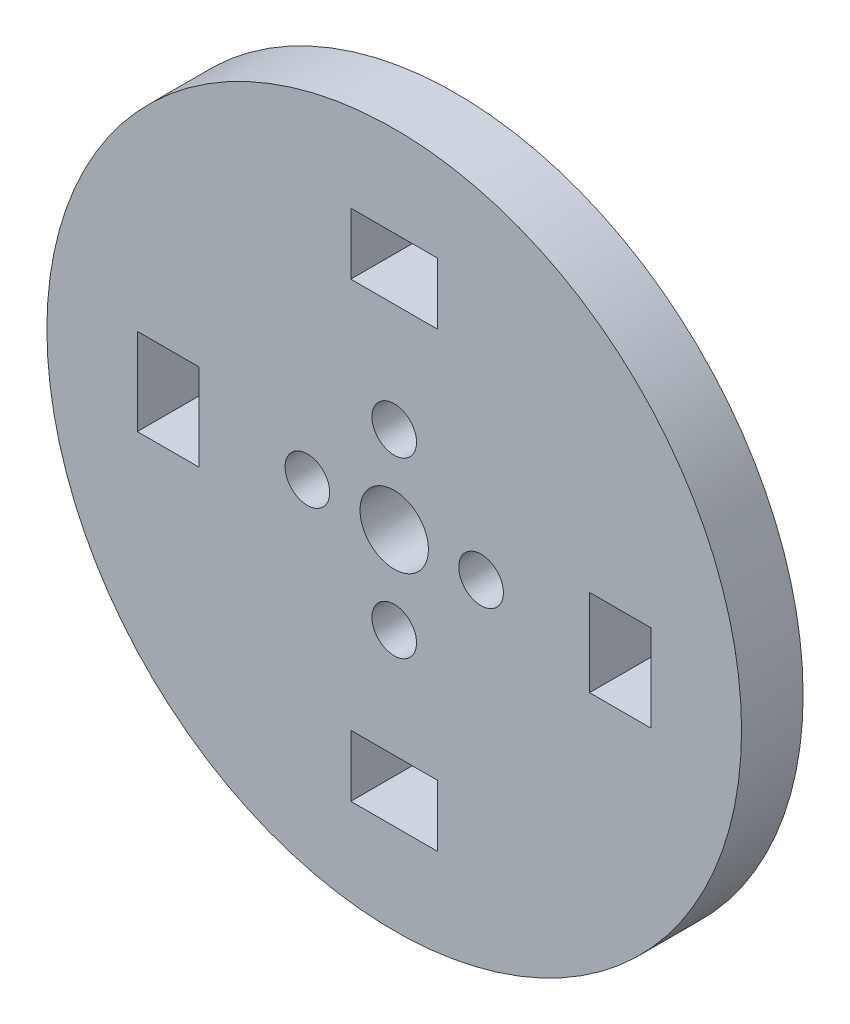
ISO-10303-21;
HEADER;
FILE_DESCRIPTION(('STEP AP214'),'2;1');
FILE_NAME('part.step','',(''),(''),'','','');
FILE_SCHEMA(('AUTOMOTIVE_DESIGN { 1 0 10303 214 1 1 1 1 }'));
ENDSEC;
DATA;
#1=APPLICATION_CONTEXT('core data for automotive mechanical design processes');
#2=APPLICATION_PROTOCOL_DEFINITION('international standard','automotive_design',2000,#1);
#3=PRODUCT_CONTEXT('',#1,'mechanical');
#4=PRODUCT('Part','Part','',(#3));
#5=PRODUCT_RELATED_PRODUCT_CATEGORY('part','',(#4));
#6=PRODUCT_DEFINITION_FORMATION('','',#4);
#7=PRODUCT_DEFINITION_CONTEXT('part definition',#1,'design');
#8=PRODUCT_DEFINITION('design','',#6,#7);
#9=PRODUCT_DEFINITION_SHAPE('','',#8);
#10=(LENGTH_UNIT() NAMED_UNIT(*) SI_UNIT(.MILLI.,.METRE.));
#11=(NAMED_UNIT(*) PLANE_ANGLE_UNIT() SI_UNIT($,.RADIAN.));
#12=(NAMED_UNIT(*) SI_UNIT($,.STERADIAN.) SOLID_ANGLE_UNIT());
#13=UNCERTAINTY_MEASURE_WITH_UNIT(LENGTH_MEASURE(1.E-05),#10,'distance_accuracy_value','');
#14=(GEOMETRIC_REPRESENTATION_CONTEXT(3) GLOBAL_UNCERTAINTY_ASSIGNED_CONTEXT((#13)) GLOBAL_UNIT_ASSIGNED_CONTEXT((#10,
#11,#12)) REPRESENTATION_CONTEXT('',''));
#15=CARTESIAN_POINT('',(0.,0.,0.));
#16=DIRECTION('',(0.,0.,1.));
#17=DIRECTION('',(1.,0.,0.));
#18=AXIS2_PLACEMENT_3D('',#15,#16,#17);
#19=CARTESIAN_POINT('',(0.,0.,4.5));
#20=DIRECTION('',(0.,0.,1.));
#21=DIRECTION('',(1.,0.,0.));
#22=AXIS2_PLACEMENT_3D('',#19,#20,#21);
#23=PLANE('',#22);
#24=CARTESIAN_POINT('',(0.,6.35,4.5));
#25=DIRECTION('',(0.,0.,1.));
#26=DIRECTION('',(1.,0.,0.));
#27=AXIS2_PLACEMENT_3D('',#24,#25,#26);
#28=CIRCLE('',#27,1.63195);
#29=CARTESIAN_POINT('',(1.63195,6.35,4.5));
#30=VERTEX_POINT('',#29);
#31=EDGE_CURVE('E310',#30,#30,#28,.T.);
#32=ORIENTED_EDGE('',*,*,#31,.F.);
#33=EDGE_LOOP('',(#32));
#34=FACE_BOUND('',#33,.T.);
#35=CARTESIAN_POINT('',(6.35000000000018,1.79700204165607E-13,4.5));
#36=DIRECTION('',(0.,0.,1.));
#37=DIRECTION('',(1.,0.,0.));
#38=AXIS2_PLACEMENT_3D('',#35,#36,#37);
#39=CIRCLE('',#38,1.63195);
#40=CARTESIAN_POINT('',(7.98195000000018,1.79700204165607E-13,4.5));
#41=VERTEX_POINT('',#40);
#42=EDGE_CURVE('E314',#41,#41,#39,.T.);
#43=ORIENTED_EDGE('',*,*,#42,.F.);
#44=EDGE_LOOP('',(#43));
#45=FACE_BOUND('',#44,.T.);
#46=CARTESIAN_POINT('',(3.59400408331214E-13,-6.35,4.5));
#47=DIRECTION('',(0.,0.,1.));
#48=DIRECTION('',(1.,0.,0.));
#49=AXIS2_PLACEMENT_3D('',#46,#47,#48);
#50=CIRCLE('',#49,1.63195);
#51=CARTESIAN_POINT('',(1.63195000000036,-6.35,4.5));
#52=VERTEX_POINT('',#51);
#53=EDGE_CURVE('E318',#52,#52,#50,.T.);
#54=ORIENTED_EDGE('',*,*,#53,.F.);
#55=EDGE_LOOP('',(#54));
#56=FACE_BOUND('',#55,.T.);
#57=CARTESIAN_POINT('',(-6.34999999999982,-1.78922553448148E-13,4.5));
#58=DIRECTION('',(0.,0.,1.));
#59=DIRECTION('',(1.,0.,0.));
#60=AXIS2_PLACEMENT_3D('',#57,#58,#59);
#61=CIRCLE('',#60,1.63195);
#62=CARTESIAN_POINT('',(-4.71804999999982,-1.78922553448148E-13,4.5));
#63=VERTEX_POINT('',#62);
#64=EDGE_CURVE('E322',#63,#63,#61,.T.);
#65=ORIENTED_EDGE('',*,*,#64,.F.);
#66=EDGE_LOOP('',(#65));
#67=FACE_BOUND('',#66,.T.);
#68=DIRECTION('',(0.,-1.,0.));
#69=VECTOR('',#68,1.);
#70=CARTESIAN_POINT('',(-3.175,0.,4.5));
#71=LINE('',#70,#69);
#72=CARTESIAN_POINT('',(-3.175,18.7835533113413,4.5));
#73=VERTEX_POINT('',#72);
#74=CARTESIAN_POINT('',(-3.175,14.2835533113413,4.5));
#75=VERTEX_POINT('',#74);
#76=EDGE_CURVE('E210',#73,#75,#71,.T.);
#77=ORIENTED_EDGE('',*,*,#76,.F.);
#78=DIRECTION('',(1.,0.,0.));
#79=VECTOR('',#78,1.);
#80=CARTESIAN_POINT('',(0.,18.7835533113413,4.5));
#81=LINE('',#80,#79);
#82=CARTESIAN_POINT('',(3.175,18.7835533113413,4.5));
#83=VERTEX_POINT('',#82);
#84=EDGE_CURVE('E221',#73,#83,#81,.T.);
#85=ORIENTED_EDGE('',*,*,#84,.T.);
#86=DIRECTION('',(0.,-1.,0.));
#87=VECTOR('',#86,1.);
#88=CARTESIAN_POINT('',(3.175,0.,4.5));
#89=LINE('',#88,#87);
#90=CARTESIAN_POINT('',(3.175,14.2835533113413,4.5));
#91=VERTEX_POINT('',#90);
#92=EDGE_CURVE('E234',#83,#91,#89,.T.);
#93=ORIENTED_EDGE('',*,*,#92,.T.);
#94=DIRECTION('',(1.,0.,0.));
#95=VECTOR('',#94,1.);
#96=CARTESIAN_POINT('',(0.,14.2835533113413,4.5));
#97=LINE('',#96,#95);
#98=EDGE_CURVE('E231',#75,#91,#97,.T.);
#99=ORIENTED_EDGE('',*,*,#98,.F.);
#100=EDGE_LOOP('',(#77,#85,#93,#99));
#101=FACE_BOUND('',#100,.T.);
#102=CARTESIAN_POINT('',(0.,0.,4.5));
#103=DIRECTION('',(0.,0.,1.));
#104=DIRECTION('',(1.,0.,0.));
#105=AXIS2_PLACEMENT_3D('',#102,#103,#104);
#106=CIRCLE('',#105,25.4);
#107=CARTESIAN_POINT('',(25.4,0.,4.5));
#108=VERTEX_POINT('',#107);
#109=EDGE_CURVE('E11',#108,#108,#106,.T.);
#110=ORIENTED_EDGE('',*,*,#109,.T.);
#111=EDGE_LOOP('',(#110));
#112=FACE_BOUND('',#111,.T.);
#113=CARTESIAN_POINT('',(0.,0.,4.5));
#114=DIRECTION('',(0.,0.,1.));
#115=DIRECTION('',(1.,0.,0.));
#116=AXIS2_PLACEMENT_3D('',#113,#114,#115);
#117=CIRCLE('',#116,2.5);
#118=CARTESIAN_POINT('',(2.5,0.,4.5));
#119=VERTEX_POINT('',#118);
#120=EDGE_CURVE('E279',#119,#119,#117,.T.);
#121=ORIENTED_EDGE('',*,*,#120,.F.);
#122=EDGE_LOOP('',(#121));
#123=FACE_BOUND('',#122,.T.);
#124=DIRECTION('',(0.,1.,0.));
#125=VECTOR('',#124,1.);
#126=CARTESIAN_POINT('',(-18.7835533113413,2.05255249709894E-13,4.5));
#127=LINE('',#126,#125);
#128=CARTESIAN_POINT('',(-18.7835533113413,-3.17499999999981,4.5));
#129=VERTEX_POINT('',#128);
#130=CARTESIAN_POINT('',(-18.7835533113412,3.17500000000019,4.5));
#131=VERTEX_POINT('',#130);
#132=EDGE_CURVE('E262',#129,#131,#127,.T.);
#133=ORIENTED_EDGE('',*,*,#132,.T.);
#134=DIRECTION('',(1.,0.,0.));
#135=VECTOR('',#134,1.);
#136=CARTESIAN_POINT('',(0.,3.175,4.5));
#137=LINE('',#136,#135);
#138=CARTESIAN_POINT('',(-14.2835533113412,3.17500000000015,4.5));
#139=VERTEX_POINT('',#138);
#140=EDGE_CURVE('E241',#131,#139,#137,.T.);
#141=ORIENTED_EDGE('',*,*,#140,.T.);
#142=DIRECTION('',(0.,1.,0.));
#143=VECTOR('',#142,1.);
#144=CARTESIAN_POINT('',(-14.2835533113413,1.4827788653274E-13,4.5));
#145=LINE('',#144,#143);
#146=CARTESIAN_POINT('',(-14.2835533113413,-3.17499999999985,4.5));
#147=VERTEX_POINT('',#146);
#148=EDGE_CURVE('E251',#147,#139,#145,.T.);
#149=ORIENTED_EDGE('',*,*,#148,.F.);
#150=DIRECTION('',(1.,0.,0.));
#151=VECTOR('',#150,1.);
#152=CARTESIAN_POINT('',(0.,-3.175,4.5));
#153=LINE('',#152,#151);
#154=EDGE_CURVE('E265',#129,#147,#153,.T.);
#155=ORIENTED_EDGE('',*,*,#154,.F.);
#156=EDGE_LOOP('',(#133,#141,#149,#155));
#157=FACE_BOUND('',#156,.T.);
#158=DIRECTION('',(0.,-1.,0.));
#159=VECTOR('',#158,1.);
#160=CARTESIAN_POINT('',(18.7835533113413,0.,4.5));
#161=LINE('',#160,#159);
#162=CARTESIAN_POINT('',(18.7835533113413,3.17499999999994,4.5));
#163=VERTEX_POINT('',#162);
#164=CARTESIAN_POINT('',(18.7835533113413,-3.17500000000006,4.5));
#165=VERTEX_POINT('',#164);
#166=EDGE_CURVE('E200',#163,#165,#161,.T.);
#167=ORIENTED_EDGE('',*,*,#166,.T.);
#168=DIRECTION('',(-1.,0.,0.));
#169=VECTOR('',#168,1.);
#170=CARTESIAN_POINT('',(0.,-3.175,4.5));
#171=LINE('',#170,#169);
#172=CARTESIAN_POINT('',(14.2835533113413,-3.17500000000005,4.5));
#173=VERTEX_POINT('',#172);
#174=EDGE_CURVE('E182',#165,#173,#171,.T.);
#175=ORIENTED_EDGE('',*,*,#174,.T.);
#176=DIRECTION('',(0.,-1.,0.));
#177=VECTOR('',#176,1.);
#178=CARTESIAN_POINT('',(14.2835533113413,0.,4.5));
#179=LINE('',#178,#177);
#180=CARTESIAN_POINT('',(14.2835533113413,3.17499999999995,4.5));
#181=VERTEX_POINT('',#180);
#182=EDGE_CURVE('E189',#181,#173,#179,.T.);
#183=ORIENTED_EDGE('',*,*,#182,.F.);
#184=DIRECTION('',(-1.,0.,0.));
#185=VECTOR('',#184,1.);
#186=CARTESIAN_POINT('',(0.,3.175,4.5));
#187=LINE('',#186,#185);
#188=EDGE_CURVE('E203',#163,#181,#187,.T.);
#189=ORIENTED_EDGE('',*,*,#188,.F.);
#190=EDGE_LOOP('',(#167,#175,#183,#189));
#191=FACE_BOUND('',#190,.T.);
#192=DIRECTION('',(-1.,0.,0.));
#193=VECTOR('',#192,1.);
#194=CARTESIAN_POINT('',(-1.23153149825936E-13,-18.7835533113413,4.5));
#195=LINE('',#194,#193);
#196=CARTESIAN_POINT('',(3.17499999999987,-18.7835533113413,4.5));
#197=VERTEX_POINT('',#196);
#198=CARTESIAN_POINT('',(-3.17500000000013,-18.7835533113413,4.5));
#199=VERTEX_POINT('',#198);
#200=EDGE_CURVE('E176',#197,#199,#195,.T.);
#201=ORIENTED_EDGE('',*,*,#200,.T.);
#202=DIRECTION('',(0.,1.,0.));
#203=VECTOR('',#202,1.);
#204=CARTESIAN_POINT('',(-3.175,0.,4.5));
#205=LINE('',#204,#203);
#206=CARTESIAN_POINT('',(-3.1750000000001,-14.2835533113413,4.5));
#207=VERTEX_POINT('',#206);
#208=EDGE_CURVE('E49',#199,#207,#205,.T.);
#209=ORIENTED_EDGE('',*,*,#208,.T.);
#210=DIRECTION('',(-1.,0.,0.));
#211=VECTOR('',#210,1.);
#212=CARTESIAN_POINT('',(-1.01453290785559E-13,-14.2835533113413,4.5));
#213=LINE('',#212,#211);
#214=CARTESIAN_POINT('',(3.1749999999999,-14.2835533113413,4.5));
#215=VERTEX_POINT('',#214);
#216=EDGE_CURVE('E164',#215,#207,#213,.T.);
#217=ORIENTED_EDGE('',*,*,#216,.F.);
#218=DIRECTION('',(0.,1.,0.));
#219=VECTOR('',#218,1.);
#220=CARTESIAN_POINT('',(3.175,0.,4.5));
#221=LINE('',#220,#219);
#222=EDGE_CURVE('E167',#197,#215,#221,.T.);
#223=ORIENTED_EDGE('',*,*,#222,.F.);
#224=EDGE_LOOP('',(#201,#209,#217,#223));
#225=FACE_BOUND('',#224,.T.);
#226=ADVANCED_FACE('F34',(#34,#45,#56,#67,#101,#112,#123,#157,#191,#225),#23,.T.);
#227=CARTESIAN_POINT('',(0.,0.,0.));
#228=DIRECTION('',(0.,0.,1.));
#229=DIRECTION('',(1.,0.,0.));
#230=AXIS2_PLACEMENT_3D('',#227,#228,#229);
#231=PLANE('',#230);
#232=CARTESIAN_POINT('',(0.,6.35,0.));
#233=DIRECTION('',(0.,0.,1.));
#234=DIRECTION('',(1.,0.,0.));
#235=AXIS2_PLACEMENT_3D('',#232,#233,#234);
#236=CIRCLE('',#235,1.63195);
#237=CARTESIAN_POINT('',(1.63195,6.35,0.));
#238=VERTEX_POINT('',#237);
#239=EDGE_CURVE('E517',#238,#238,#236,.T.);
#240=ORIENTED_EDGE('',*,*,#239,.T.);
#241=EDGE_LOOP('',(#240));
#242=FACE_BOUND('',#241,.T.);
#243=CARTESIAN_POINT('',(6.35000000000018,1.79700204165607E-13,0.));
#244=DIRECTION('',(0.,0.,1.));
#245=DIRECTION('',(1.,0.,0.));
#246=AXIS2_PLACEMENT_3D('',#243,#244,#245);
#247=CIRCLE('',#246,1.63195);
#248=CARTESIAN_POINT('',(7.98195000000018,1.79700204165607E-13,0.));
#249=VERTEX_POINT('',#248);
#250=EDGE_CURVE('E519',#249,#249,#247,.T.);
#251=ORIENTED_EDGE('',*,*,#250,.T.);
#252=EDGE_LOOP('',(#251));
#253=FACE_BOUND('',#252,.T.);
#254=CARTESIAN_POINT('',(3.59400408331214E-13,-6.35,0.));
#255=DIRECTION('',(0.,0.,1.));
#256=DIRECTION('',(1.,0.,0.));
#257=AXIS2_PLACEMENT_3D('',#254,#255,#256);
#258=CIRCLE('',#257,1.63195);
#259=CARTESIAN_POINT('',(1.63195000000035,-6.35,0.));
#260=VERTEX_POINT('',#259);
#261=EDGE_CURVE('E526',#260,#260,#258,.T.);
#262=ORIENTED_EDGE('',*,*,#261,.T.);
#263=EDGE_LOOP('',(#262));
#264=FACE_BOUND('',#263,.T.);
#265=CARTESIAN_POINT('',(-6.34999999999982,-1.78922553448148E-13,0.));
#266=DIRECTION('',(0.,0.,1.));
#267=DIRECTION('',(1.,0.,0.));
#268=AXIS2_PLACEMENT_3D('',#265,#266,#267);
#269=CIRCLE('',#268,1.63195);
#270=CARTESIAN_POINT('',(-4.71804999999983,-1.78922553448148E-13,0.));
#271=VERTEX_POINT('',#270);
#272=EDGE_CURVE('E170',#271,#271,#269,.T.);
#273=ORIENTED_EDGE('',*,*,#272,.T.);
#274=EDGE_LOOP('',(#273));
#275=FACE_BOUND('',#274,.T.);
#276=DIRECTION('',(-1.,0.,0.));
#277=VECTOR('',#276,1.);
#278=CARTESIAN_POINT('',(0.,-3.175,0.));
#279=LINE('',#278,#277);
#280=CARTESIAN_POINT('',(18.7835533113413,-3.17500000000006,0.));
#281=VERTEX_POINT('',#280);
#282=CARTESIAN_POINT('',(14.2835533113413,-3.17500000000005,0.));
#283=VERTEX_POINT('',#282);
#284=EDGE_CURVE('E186',#281,#283,#279,.T.);
#285=ORIENTED_EDGE('',*,*,#284,.F.);
#286=DIRECTION('',(0.,-1.,0.));
#287=VECTOR('',#286,1.);
#288=CARTESIAN_POINT('',(18.7835533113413,0.,0.));
#289=LINE('',#288,#287);
#290=CARTESIAN_POINT('',(18.7835533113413,3.17499999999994,0.));
#291=VERTEX_POINT('',#290);
#292=EDGE_CURVE('E188',#291,#281,#289,.T.);
#293=ORIENTED_EDGE('',*,*,#292,.F.);
#294=DIRECTION('',(-1.,0.,0.));
#295=VECTOR('',#294,1.);
#296=CARTESIAN_POINT('',(0.,3.175,0.));
#297=LINE('',#296,#295);
#298=CARTESIAN_POINT('',(14.2835533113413,3.17499999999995,0.));
#299=VERTEX_POINT('',#298);
#300=EDGE_CURVE('E191',#291,#299,#297,.T.);
#301=ORIENTED_EDGE('',*,*,#300,.T.);
#302=DIRECTION('',(0.,-1.,0.));
#303=VECTOR('',#302,1.);
#304=CARTESIAN_POINT('',(14.2835533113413,0.,0.));
#305=LINE('',#304,#303);
#306=EDGE_CURVE('E194',#299,#283,#305,.T.);
#307=ORIENTED_EDGE('',*,*,#306,.T.);
#308=EDGE_LOOP('',(#285,#293,#301,#307));
#309=FACE_BOUND('',#308,.T.);
#310=DIRECTION('',(1.,0.,0.));
#311=VECTOR('',#310,1.);
#312=CARTESIAN_POINT('',(0.,18.7835533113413,0.));
#313=LINE('',#312,#311);
#314=CARTESIAN_POINT('',(-3.175,18.7835533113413,0.));
#315=VERTEX_POINT('',#314);
#316=CARTESIAN_POINT('',(3.175,18.7835533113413,0.));
#317=VERTEX_POINT('',#316);
#318=EDGE_CURVE('E227',#315,#317,#313,.T.);
#319=ORIENTED_EDGE('',*,*,#318,.F.);
#320=DIRECTION('',(0.,-1.,0.));
#321=VECTOR('',#320,1.);
#322=CARTESIAN_POINT('',(-3.175,0.,0.));
#323=LINE('',#322,#321);
#324=CARTESIAN_POINT('',(-3.175,14.2835533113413,0.));
#325=VERTEX_POINT('',#324);
#326=EDGE_CURVE('E217',#315,#325,#323,.T.);
#327=ORIENTED_EDGE('',*,*,#326,.T.);
#328=DIRECTION('',(1.,0.,0.));
#329=VECTOR('',#328,1.);
#330=CARTESIAN_POINT('',(0.,14.2835533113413,0.));
#331=LINE('',#330,#329);
#332=CARTESIAN_POINT('',(3.175,14.2835533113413,0.));
#333=VERTEX_POINT('',#332);
#334=EDGE_CURVE('E220',#325,#333,#331,.T.);
#335=ORIENTED_EDGE('',*,*,#334,.T.);
#336=DIRECTION('',(0.,-1.,0.));
#337=VECTOR('',#336,1.);
#338=CARTESIAN_POINT('',(3.175,0.,0.));
#339=LINE('',#338,#337);
#340=EDGE_CURVE('E224',#317,#333,#339,.T.);
#341=ORIENTED_EDGE('',*,*,#340,.F.);
#342=EDGE_LOOP('',(#319,#327,#335,#341));
#343=FACE_BOUND('',#342,.T.);
#344=CARTESIAN_POINT('',(0.,0.,0.));
#345=DIRECTION('',(0.,0.,1.));
#346=DIRECTION('',(1.,0.,0.));
#347=AXIS2_PLACEMENT_3D('',#344,#345,#346);
#348=CIRCLE('',#347,2.5);
#349=CARTESIAN_POINT('',(2.5,0.,0.));
#350=VERTEX_POINT('',#349);
#351=EDGE_CURVE('E272',#350,#350,#348,.T.);
#352=ORIENTED_EDGE('',*,*,#351,.T.);
#353=EDGE_LOOP('',(#352));
#354=FACE_BOUND('',#353,.T.);
#355=CARTESIAN_POINT('',(0.,0.,0.));
#356=DIRECTION('',(0.,0.,1.));
#357=DIRECTION('',(1.,0.,0.));
#358=AXIS2_PLACEMENT_3D('',#355,#356,#357);
#359=CIRCLE('',#358,25.4);
#360=CARTESIAN_POINT('',(25.4,0.,0.));
#361=VERTEX_POINT('',#360);
#362=EDGE_CURVE('E38',#361,#361,#359,.T.);
#363=ORIENTED_EDGE('',*,*,#362,.F.);
#364=EDGE_LOOP('',(#363));
#365=FACE_BOUND('',#364,.T.);
#366=DIRECTION('',(1.,0.,0.));
#367=VECTOR('',#366,1.);
#368=CARTESIAN_POINT('',(0.,3.175,0.));
#369=LINE('',#368,#367);
#370=CARTESIAN_POINT('',(-18.7835533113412,3.17500000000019,0.));
#371=VERTEX_POINT('',#370);
#372=CARTESIAN_POINT('',(-14.2835533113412,3.17500000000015,0.));
#373=VERTEX_POINT('',#372);
#374=EDGE_CURVE('E248',#371,#373,#369,.T.);
#375=ORIENTED_EDGE('',*,*,#374,.F.);
#376=DIRECTION('',(0.,1.,0.));
#377=VECTOR('',#376,1.);
#378=CARTESIAN_POINT('',(-18.7835533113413,2.05255249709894E-13,0.));
#379=LINE('',#378,#377);
#380=CARTESIAN_POINT('',(-18.7835533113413,-3.17499999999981,0.));
#381=VERTEX_POINT('',#380);
#382=EDGE_CURVE('E250',#381,#371,#379,.T.);
#383=ORIENTED_EDGE('',*,*,#382,.F.);
#384=DIRECTION('',(1.,0.,0.));
#385=VECTOR('',#384,1.);
#386=CARTESIAN_POINT('',(0.,-3.175,0.));
#387=LINE('',#386,#385);
#388=CARTESIAN_POINT('',(-14.2835533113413,-3.17499999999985,0.));
#389=VERTEX_POINT('',#388);
#390=EDGE_CURVE('E253',#381,#389,#387,.T.);
#391=ORIENTED_EDGE('',*,*,#390,.T.);
#392=DIRECTION('',(0.,1.,0.));
#393=VECTOR('',#392,1.);
#394=CARTESIAN_POINT('',(-14.2835533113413,1.4827788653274E-13,0.));
#395=LINE('',#394,#393);
#396=EDGE_CURVE('E256',#389,#373,#395,.T.);
#397=ORIENTED_EDGE('',*,*,#396,.T.);
#398=EDGE_LOOP('',(#375,#383,#391,#397));
#399=FACE_BOUND('',#398,.T.);
#400=DIRECTION('',(0.,1.,0.));
#401=VECTOR('',#400,1.);
#402=CARTESIAN_POINT('',(-3.175,0.,0.));
#403=LINE('',#402,#401);
#404=CARTESIAN_POINT('',(-3.17500000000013,-18.7835533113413,0.));
#405=VERTEX_POINT('',#404);
#406=CARTESIAN_POINT('',(-3.1750000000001,-14.2835533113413,0.));
#407=VERTEX_POINT('',#406);
#408=EDGE_CURVE('E155',#405,#407,#403,.T.);
#409=ORIENTED_EDGE('',*,*,#408,.F.);
#410=DIRECTION('',(-1.,0.,0.));
#411=VECTOR('',#410,1.);
#412=CARTESIAN_POINT('',(-1.23153149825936E-13,-18.7835533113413,0.));
#413=LINE('',#412,#411);
#414=CARTESIAN_POINT('',(3.17499999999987,-18.7835533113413,0.));
#415=VERTEX_POINT('',#414);
#416=EDGE_CURVE('E147',#415,#405,#413,.T.);
#417=ORIENTED_EDGE('',*,*,#416,.F.);
#418=DIRECTION('',(0.,1.,0.));
#419=VECTOR('',#418,1.);
#420=CARTESIAN_POINT('',(3.175,0.,0.));
#421=LINE('',#420,#419);
#422=CARTESIAN_POINT('',(3.1749999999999,-14.2835533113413,0.));
#423=VERTEX_POINT('',#422);
#424=EDGE_CURVE('E57',#415,#423,#421,.T.);
#425=ORIENTED_EDGE('',*,*,#424,.T.);
#426=DIRECTION('',(-1.,0.,0.));
#427=VECTOR('',#426,1.);
#428=CARTESIAN_POINT('',(-1.01453290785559E-13,-14.2835533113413,0.));
#429=LINE('',#428,#427);
#430=EDGE_CURVE('E159',#423,#407,#429,.T.);
#431=ORIENTED_EDGE('',*,*,#430,.T.);
#432=EDGE_LOOP('',(#409,#417,#425,#431));
#433=FACE_BOUND('',#432,.T.);
#434=ADVANCED_FACE('F162',(#242,#253,#264,#275,#309,#343,#354,#365,#399,#433),#231,.F.);
#435=CARTESIAN_POINT('',(0.,0.,4.5));
#436=DIRECTION('',(0.,0.,-1.));
#437=DIRECTION('',(-1.,0.,0.));
#438=AXIS2_PLACEMENT_3D('',#435,#436,#437);
#439=CYLINDRICAL_SURFACE('',#438,25.4);
#440=ORIENTED_EDGE('',*,*,#109,.F.);
#441=EDGE_LOOP('',(#440));
#442=FACE_BOUND('',#441,.T.);
#443=ORIENTED_EDGE('',*,*,#362,.T.);
#444=EDGE_LOOP('',(#443));
#445=FACE_BOUND('',#444,.T.);
#446=ADVANCED_FACE('F36',(#442,#445),#439,.T.);
#447=CARTESIAN_POINT('',(0.,0.,4.5));
#448=DIRECTION('',(0.,0.,-1.));
#449=DIRECTION('',(-1.,0.,0.));
#450=AXIS2_PLACEMENT_3D('',#447,#448,#449);
#451=CYLINDRICAL_SURFACE('',#450,2.5);
#452=ORIENTED_EDGE('',*,*,#120,.T.);
#453=EDGE_LOOP('',(#452));
#454=FACE_BOUND('',#453,.T.);
#455=ORIENTED_EDGE('',*,*,#351,.F.);
#456=EDGE_LOOP('',(#455));
#457=FACE_BOUND('',#456,.T.);
#458=ADVANCED_FACE('F287',(#454,#457),#451,.F.);
#459=CARTESIAN_POINT('',(0.,3.175,0.));
#460=DIRECTION('',(0.,-1.,0.));
#461=DIRECTION('',(1.,0.,0.));
#462=AXIS2_PLACEMENT_3D('',#459,#460,#461);
#463=PLANE('',#462);
#464=ORIENTED_EDGE('',*,*,#140,.F.);
#465=DIRECTION('',(0.,0.,1.));
#466=VECTOR('',#465,1.);
#467=CARTESIAN_POINT('',(-18.7835533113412,3.17500000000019,0.));
#468=LINE('',#467,#466);
#469=EDGE_CURVE('E259',#371,#131,#468,.T.);
#470=ORIENTED_EDGE('',*,*,#469,.F.);
#471=ORIENTED_EDGE('',*,*,#374,.T.);
#472=DIRECTION('',(0.,0.,1.));
#473=VECTOR('',#472,1.);
#474=CARTESIAN_POINT('',(-14.2835533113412,3.17500000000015,0.));
#475=LINE('',#474,#473);
#476=EDGE_CURVE('E270',#373,#139,#475,.T.);
#477=ORIENTED_EDGE('',*,*,#476,.T.);
#478=EDGE_LOOP('',(#464,#470,#471,#477));
#479=FACE_BOUND('',#478,.T.);
#480=ADVANCED_FACE('F289',(#479),#463,.T.);
#481=CARTESIAN_POINT('',(-14.2835533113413,1.4827788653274E-13,0.));
#482=DIRECTION('',(1.,0.,0.));
#483=DIRECTION('',(0.,1.,0.));
#484=AXIS2_PLACEMENT_3D('',#481,#482,#483);
#485=PLANE('',#484);
#486=ORIENTED_EDGE('',*,*,#148,.T.);
#487=ORIENTED_EDGE('',*,*,#476,.F.);
#488=ORIENTED_EDGE('',*,*,#396,.F.);
#489=DIRECTION('',(0.,0.,1.));
#490=VECTOR('',#489,1.);
#491=CARTESIAN_POINT('',(-14.2835533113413,-3.17499999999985,0.));
#492=LINE('',#491,#490);
#493=EDGE_CURVE('E273',#389,#147,#492,.T.);
#494=ORIENTED_EDGE('',*,*,#493,.T.);
#495=EDGE_LOOP('',(#486,#487,#488,#494));
#496=FACE_BOUND('',#495,.T.);
#497=ADVANCED_FACE('F296',(#496),#485,.F.);
#498=CARTESIAN_POINT('',(0.,-3.175,0.));
#499=DIRECTION('',(0.,-1.,0.));
#500=DIRECTION('',(1.,0.,0.));
#501=AXIS2_PLACEMENT_3D('',#498,#499,#500);
#502=PLANE('',#501);
#503=ORIENTED_EDGE('',*,*,#154,.T.);
#504=ORIENTED_EDGE('',*,*,#493,.F.);
#505=ORIENTED_EDGE('',*,*,#390,.F.);
#506=DIRECTION('',(0.,0.,1.));
#507=VECTOR('',#506,1.);
#508=CARTESIAN_POINT('',(-18.7835533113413,-3.17499999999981,0.));
#509=LINE('',#508,#507);
#510=EDGE_CURVE('E275',#381,#129,#509,.T.);
#511=ORIENTED_EDGE('',*,*,#510,.T.);
#512=EDGE_LOOP('',(#503,#504,#505,#511));
#513=FACE_BOUND('',#512,.T.);
#514=ADVANCED_FACE('F390',(#513),#502,.F.);
#515=CARTESIAN_POINT('',(-18.7835533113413,2.05255249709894E-13,0.));
#516=DIRECTION('',(1.,0.,0.));
#517=DIRECTION('',(0.,1.,0.));
#518=AXIS2_PLACEMENT_3D('',#515,#516,#517);
#519=PLANE('',#518);
#520=ORIENTED_EDGE('',*,*,#132,.F.);
#521=ORIENTED_EDGE('',*,*,#510,.F.);
#522=ORIENTED_EDGE('',*,*,#382,.T.);
#523=ORIENTED_EDGE('',*,*,#469,.T.);
#524=EDGE_LOOP('',(#520,#521,#522,#523));
#525=FACE_BOUND('',#524,.T.);
#526=ADVANCED_FACE('F386',(#525),#519,.T.);
#527=CARTESIAN_POINT('',(-3.175,0.,0.));
#528=DIRECTION('',(-1.,0.,0.));
#529=DIRECTION('',(0.,-1.,0.));
#530=AXIS2_PLACEMENT_3D('',#527,#528,#529);
#531=PLANE('',#530);
#532=ORIENTED_EDGE('',*,*,#76,.T.);
#533=DIRECTION('',(0.,0.,1.));
#534=VECTOR('',#533,1.);
#535=CARTESIAN_POINT('',(-3.175,14.2835533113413,0.));
#536=LINE('',#535,#534);
#537=EDGE_CURVE('E229',#325,#75,#536,.T.);
#538=ORIENTED_EDGE('',*,*,#537,.F.);
#539=ORIENTED_EDGE('',*,*,#326,.F.);
#540=DIRECTION('',(0.,0.,1.));
#541=VECTOR('',#540,1.);
#542=CARTESIAN_POINT('',(-3.175,18.7835533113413,0.));
#543=LINE('',#542,#541);
#544=EDGE_CURVE('E239',#315,#73,#543,.T.);
#545=ORIENTED_EDGE('',*,*,#544,.T.);
#546=EDGE_LOOP('',(#532,#538,#539,#545));
#547=FACE_BOUND('',#546,.T.);
#548=ADVANCED_FACE('F376',(#547),#531,.F.);
#549=CARTESIAN_POINT('',(0.,18.7835533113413,0.));
#550=DIRECTION('',(0.,-1.,0.));
#551=DIRECTION('',(0.,0.,-1.));
#552=AXIS2_PLACEMENT_3D('',#549,#550,#551);
#553=PLANE('',#552);
#554=ORIENTED_EDGE('',*,*,#84,.F.);
#555=ORIENTED_EDGE('',*,*,#544,.F.);
#556=ORIENTED_EDGE('',*,*,#318,.T.);
#557=DIRECTION('',(0.,0.,1.));
#558=VECTOR('',#557,1.);
#559=CARTESIAN_POINT('',(3.175,18.7835533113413,0.));
#560=LINE('',#559,#558);
#561=EDGE_CURVE('E242',#317,#83,#560,.T.);
#562=ORIENTED_EDGE('',*,*,#561,.T.);
#563=EDGE_LOOP('',(#554,#555,#556,#562));
#564=FACE_BOUND('',#563,.T.);
#565=ADVANCED_FACE('F372',(#564),#553,.T.);
#566=CARTESIAN_POINT('',(3.175,0.,0.));
#567=DIRECTION('',(-1.,0.,0.));
#568=DIRECTION('',(0.,-1.,0.));
#569=AXIS2_PLACEMENT_3D('',#566,#567,#568);
#570=PLANE('',#569);
#571=ORIENTED_EDGE('',*,*,#92,.F.);
#572=ORIENTED_EDGE('',*,*,#561,.F.);
#573=ORIENTED_EDGE('',*,*,#340,.T.);
#574=DIRECTION('',(0.,0.,1.));
#575=VECTOR('',#574,1.);
#576=CARTESIAN_POINT('',(3.175,14.2835533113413,0.));
#577=LINE('',#576,#575);
#578=EDGE_CURVE('E244',#333,#91,#577,.T.);
#579=ORIENTED_EDGE('',*,*,#578,.T.);
#580=EDGE_LOOP('',(#571,#572,#573,#579));
#581=FACE_BOUND('',#580,.T.);
#582=ADVANCED_FACE('F375',(#581),#570,.T.);
#583=CARTESIAN_POINT('',(0.,14.2835533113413,0.));
#584=DIRECTION('',(0.,-1.,0.));
#585=DIRECTION('',(0.,0.,-1.));
#586=AXIS2_PLACEMENT_3D('',#583,#584,#585);
#587=PLANE('',#586);
#588=ORIENTED_EDGE('',*,*,#98,.T.);
#589=ORIENTED_EDGE('',*,*,#578,.F.);
#590=ORIENTED_EDGE('',*,*,#334,.F.);
#591=ORIENTED_EDGE('',*,*,#537,.T.);
#592=EDGE_LOOP('',(#588,#589,#590,#591));
#593=FACE_BOUND('',#592,.T.);
#594=ADVANCED_FACE('F370',(#593),#587,.F.);
#595=CARTESIAN_POINT('',(0.,-3.175,0.));
#596=DIRECTION('',(0.,1.,0.));
#597=DIRECTION('',(-1.,0.,0.));
#598=AXIS2_PLACEMENT_3D('',#595,#596,#597);
#599=PLANE('',#598);
#600=ORIENTED_EDGE('',*,*,#174,.F.);
#601=DIRECTION('',(0.,0.,1.));
#602=VECTOR('',#601,1.);
#603=CARTESIAN_POINT('',(18.7835533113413,-3.17500000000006,0.));
#604=LINE('',#603,#602);
#605=EDGE_CURVE('E197',#281,#165,#604,.T.);
#606=ORIENTED_EDGE('',*,*,#605,.F.);
#607=ORIENTED_EDGE('',*,*,#284,.T.);
#608=DIRECTION('',(0.,0.,1.));
#609=VECTOR('',#608,1.);
#610=CARTESIAN_POINT('',(14.2835533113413,-3.17500000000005,0.));
#611=LINE('',#610,#609);
#612=EDGE_CURVE('E208',#283,#173,#611,.T.);
#613=ORIENTED_EDGE('',*,*,#612,.T.);
#614=EDGE_LOOP('',(#600,#606,#607,#613));
#615=FACE_BOUND('',#614,.T.);
#616=ADVANCED_FACE('F360',(#615),#599,.T.);
#617=CARTESIAN_POINT('',(14.2835533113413,0.,0.));
#618=DIRECTION('',(-1.,0.,0.));
#619=DIRECTION('',(0.,-1.,0.));
#620=AXIS2_PLACEMENT_3D('',#617,#618,#619);
#621=PLANE('',#620);
#622=ORIENTED_EDGE('',*,*,#182,.T.);
#623=ORIENTED_EDGE('',*,*,#612,.F.);
#624=ORIENTED_EDGE('',*,*,#306,.F.);
#625=DIRECTION('',(0.,0.,1.));
#626=VECTOR('',#625,1.);
#627=CARTESIAN_POINT('',(14.2835533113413,3.17499999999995,0.));
#628=LINE('',#627,#626);
#629=EDGE_CURVE('E211',#299,#181,#628,.T.);
#630=ORIENTED_EDGE('',*,*,#629,.T.);
#631=EDGE_LOOP('',(#622,#623,#624,#630));
#632=FACE_BOUND('',#631,.T.);
#633=ADVANCED_FACE('F356',(#632),#621,.F.);
#634=CARTESIAN_POINT('',(0.,3.175,0.));
#635=DIRECTION('',(0.,1.,0.));
#636=DIRECTION('',(-1.,0.,0.));
#637=AXIS2_PLACEMENT_3D('',#634,#635,#636);
#638=PLANE('',#637);
#639=ORIENTED_EDGE('',*,*,#188,.T.);
#640=ORIENTED_EDGE('',*,*,#629,.F.);
#641=ORIENTED_EDGE('',*,*,#300,.F.);
#642=DIRECTION('',(0.,0.,1.));
#643=VECTOR('',#642,1.);
#644=CARTESIAN_POINT('',(18.7835533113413,3.17499999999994,0.));
#645=LINE('',#644,#643);
#646=EDGE_CURVE('E213',#291,#163,#645,.T.);
#647=ORIENTED_EDGE('',*,*,#646,.T.);
#648=EDGE_LOOP('',(#639,#640,#641,#647));
#649=FACE_BOUND('',#648,.T.);
#650=ADVANCED_FACE('F359',(#649),#638,.F.);
#651=CARTESIAN_POINT('',(18.7835533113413,0.,0.));
#652=DIRECTION('',(-1.,0.,0.));
#653=DIRECTION('',(0.,-1.,0.));
#654=AXIS2_PLACEMENT_3D('',#651,#652,#653);
#655=PLANE('',#654);
#656=ORIENTED_EDGE('',*,*,#166,.F.);
#657=ORIENTED_EDGE('',*,*,#646,.F.);
#658=ORIENTED_EDGE('',*,*,#292,.T.);
#659=ORIENTED_EDGE('',*,*,#605,.T.);
#660=EDGE_LOOP('',(#656,#657,#658,#659));
#661=FACE_BOUND('',#660,.T.);
#662=ADVANCED_FACE('F348',(#661),#655,.T.);
#663=CARTESIAN_POINT('',(-3.175,0.,0.));
#664=DIRECTION('',(1.,0.,0.));
#665=DIRECTION('',(0.,1.,0.));
#666=AXIS2_PLACEMENT_3D('',#663,#664,#665);
#667=PLANE('',#666);
#668=ORIENTED_EDGE('',*,*,#208,.F.);
#669=DIRECTION('',(0.,0.,1.));
#670=VECTOR('',#669,1.);
#671=CARTESIAN_POINT('',(-3.17500000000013,-18.7835533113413,0.));
#672=LINE('',#671,#670);
#673=EDGE_CURVE('E150',#405,#199,#672,.T.);
#674=ORIENTED_EDGE('',*,*,#673,.F.);
#675=ORIENTED_EDGE('',*,*,#408,.T.);
#676=DIRECTION('',(0.,0.,1.));
#677=VECTOR('',#676,1.);
#678=CARTESIAN_POINT('',(-3.1750000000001,-14.2835533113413,0.));
#679=LINE('',#678,#677);
#680=EDGE_CURVE('E180',#407,#207,#679,.T.);
#681=ORIENTED_EDGE('',*,*,#680,.T.);
#682=EDGE_LOOP('',(#668,#674,#675,#681));
#683=FACE_BOUND('',#682,.T.);
#684=ADVANCED_FACE('F157',(#683),#667,.T.);
#685=CARTESIAN_POINT('',(-1.01453290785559E-13,-14.2835533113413,0.));
#686=DIRECTION('',(0.,1.,0.));
#687=DIRECTION('',(-1.,0.,0.));
#688=AXIS2_PLACEMENT_3D('',#685,#686,#687);
#689=PLANE('',#688);
#690=ORIENTED_EDGE('',*,*,#216,.T.);
#691=ORIENTED_EDGE('',*,*,#680,.F.);
#692=ORIENTED_EDGE('',*,*,#430,.F.);
#693=DIRECTION('',(0.,0.,1.));
#694=VECTOR('',#693,1.);
#695=CARTESIAN_POINT('',(3.1749999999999,-14.2835533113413,0.));
#696=LINE('',#695,#694);
#697=EDGE_CURVE('E183',#423,#215,#696,.T.);
#698=ORIENTED_EDGE('',*,*,#697,.T.);
#699=EDGE_LOOP('',(#690,#691,#692,#698));
#700=FACE_BOUND('',#699,.T.);
#701=ADVANCED_FACE('F340',(#700),#689,.F.);
#702=CARTESIAN_POINT('',(3.175,0.,0.));
#703=DIRECTION('',(1.,0.,0.));
#704=DIRECTION('',(0.,1.,0.));
#705=AXIS2_PLACEMENT_3D('',#702,#703,#704);
#706=PLANE('',#705);
#707=ORIENTED_EDGE('',*,*,#222,.T.);
#708=ORIENTED_EDGE('',*,*,#697,.F.);
#709=ORIENTED_EDGE('',*,*,#424,.F.);
#710=DIRECTION('',(0.,0.,1.));
#711=VECTOR('',#710,1.);
#712=CARTESIAN_POINT('',(3.17499999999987,-18.7835533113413,0.));
#713=LINE('',#712,#711);
#714=EDGE_CURVE('E152',#415,#197,#713,.T.);
#715=ORIENTED_EDGE('',*,*,#714,.T.);
#716=EDGE_LOOP('',(#707,#708,#709,#715));
#717=FACE_BOUND('',#716,.T.);
#718=ADVANCED_FACE('F338',(#717),#706,.F.);
#719=CARTESIAN_POINT('',(-1.23153149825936E-13,-18.7835533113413,0.));
#720=DIRECTION('',(0.,1.,0.));
#721=DIRECTION('',(-1.,0.,0.));
#722=AXIS2_PLACEMENT_3D('',#719,#720,#721);
#723=PLANE('',#722);
#724=ORIENTED_EDGE('',*,*,#200,.F.);
#725=ORIENTED_EDGE('',*,*,#714,.F.);
#726=ORIENTED_EDGE('',*,*,#416,.T.);
#727=ORIENTED_EDGE('',*,*,#673,.T.);
#728=EDGE_LOOP('',(#724,#725,#726,#727));
#729=FACE_BOUND('',#728,.T.);
#730=ADVANCED_FACE('F149',(#729),#723,.T.);
#731=CARTESIAN_POINT('',(-6.34999999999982,-1.78922553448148E-13,4.5));
#732=DIRECTION('',(0.,0.,1.));
#733=DIRECTION('',(1.,0.,0.));
#734=AXIS2_PLACEMENT_3D('',#731,#732,#733);
#735=CYLINDRICAL_SURFACE('',#734,1.63195);
#736=ORIENTED_EDGE('',*,*,#64,.T.);
#737=EDGE_LOOP('',(#736));
#738=FACE_BOUND('',#737,.T.);
#739=ORIENTED_EDGE('',*,*,#272,.F.);
#740=EDGE_LOOP('',(#739));
#741=FACE_BOUND('',#740,.T.);
#742=ADVANCED_FACE('F351',(#738,#741),#735,.F.);
#743=CARTESIAN_POINT('',(3.59400408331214E-13,-6.35,4.5));
#744=DIRECTION('',(0.,0.,1.));
#745=DIRECTION('',(1.,0.,0.));
#746=AXIS2_PLACEMENT_3D('',#743,#744,#745);
#747=CYLINDRICAL_SURFACE('',#746,1.63195);
#748=ORIENTED_EDGE('',*,*,#53,.T.);
#749=EDGE_LOOP('',(#748));
#750=FACE_BOUND('',#749,.T.);
#751=ORIENTED_EDGE('',*,*,#261,.F.);
#752=EDGE_LOOP('',(#751));
#753=FACE_BOUND('',#752,.T.);
#754=ADVANCED_FACE('F482',(#750,#753),#747,.F.);
#755=CARTESIAN_POINT('',(6.35000000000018,1.79700204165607E-13,4.5));
#756=DIRECTION('',(0.,0.,1.));
#757=DIRECTION('',(1.,0.,0.));
#758=AXIS2_PLACEMENT_3D('',#755,#756,#757);
#759=CYLINDRICAL_SURFACE('',#758,1.63195);
#760=ORIENTED_EDGE('',*,*,#42,.T.);
#761=EDGE_LOOP('',(#760));
#762=FACE_BOUND('',#761,.T.);
#763=ORIENTED_EDGE('',*,*,#250,.F.);
#764=EDGE_LOOP('',(#763));
#765=FACE_BOUND('',#764,.T.);
#766=ADVANCED_FACE('F491',(#762,#765),#759,.F.);
#767=CARTESIAN_POINT('',(0.,6.35,4.5));
#768=DIRECTION('',(0.,0.,1.));
#769=DIRECTION('',(1.,0.,0.));
#770=AXIS2_PLACEMENT_3D('',#767,#768,#769);
#771=CYLINDRICAL_SURFACE('',#770,1.63195);
#772=ORIENTED_EDGE('',*,*,#31,.T.);
#773=EDGE_LOOP('',(#772));
#774=FACE_BOUND('',#773,.T.);
#775=ORIENTED_EDGE('',*,*,#239,.F.);
#776=EDGE_LOOP('',(#775));
#777=FACE_BOUND('',#776,.T.);
#778=ADVANCED_FACE('F500',(#774,#777),#771,.F.);
#779=CLOSED_SHELL('',(#226,#434,#446,#458,#480,#497,#514,#526,#548,#565,#582,#594,#616,#633,
#650,#662,#684,#701,#718,#730,#742,#754,#766,#778));
#780=MANIFOLD_SOLID_BREP('B2',#779);
#781=ADVANCED_BREP_SHAPE_REPRESENTATION('',(#18,#780),#14);
#782=SHAPE_DEFINITION_REPRESENTATION(#9,#781);
ENDSEC;
END-ISO-10303-21;
